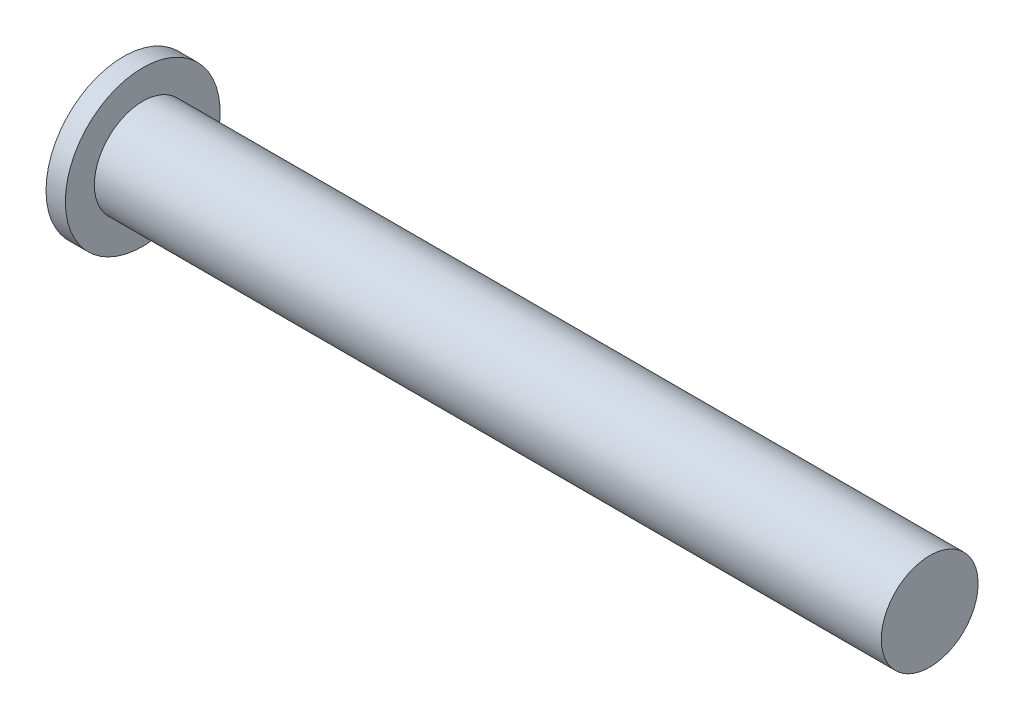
ISO-10303-21;
HEADER;
FILE_DESCRIPTION(('STEP AP214'),'2;1');
FILE_NAME('part.step','',(''),(''),'','','');
FILE_SCHEMA(('AUTOMOTIVE_DESIGN { 1 0 10303 214 1 1 1 1 }'));
ENDSEC;
DATA;
#1=APPLICATION_CONTEXT('core data for automotive mechanical design processes');
#2=APPLICATION_PROTOCOL_DEFINITION('international standard','automotive_design',2000,#1);
#3=PRODUCT_CONTEXT('',#1,'mechanical');
#4=PRODUCT('Part','Part','',(#3));
#5=PRODUCT_RELATED_PRODUCT_CATEGORY('part','',(#4));
#6=PRODUCT_DEFINITION_FORMATION('','',#4);
#7=PRODUCT_DEFINITION_CONTEXT('part definition',#1,'design');
#8=PRODUCT_DEFINITION('design','',#6,#7);
#9=PRODUCT_DEFINITION_SHAPE('','',#8);
#10=(LENGTH_UNIT() NAMED_UNIT(*) SI_UNIT(.MILLI.,.METRE.));
#11=(NAMED_UNIT(*) PLANE_ANGLE_UNIT() SI_UNIT($,.RADIAN.));
#12=(NAMED_UNIT(*) SI_UNIT($,.STERADIAN.) SOLID_ANGLE_UNIT());
#13=UNCERTAINTY_MEASURE_WITH_UNIT(LENGTH_MEASURE(1.E-05),#10,'distance_accuracy_value','');
#14=(GEOMETRIC_REPRESENTATION_CONTEXT(3) GLOBAL_UNCERTAINTY_ASSIGNED_CONTEXT((#13)) GLOBAL_UNIT_ASSIGNED_CONTEXT((#10,
#11,#12)) REPRESENTATION_CONTEXT('',''));
#15=CARTESIAN_POINT('',(0.,0.,0.));
#16=DIRECTION('',(0.,0.,1.));
#17=DIRECTION('',(1.,0.,0.));
#18=AXIS2_PLACEMENT_3D('',#15,#16,#17);
#19=CARTESIAN_POINT('',(0.,0.,0.));
#20=DIRECTION('',(1.,0.,0.));
#21=DIRECTION('',(0.,0.,-1.));
#22=AXIS2_PLACEMENT_3D('',#19,#20,#21);
#23=PLANE('',#22);
#24=CARTESIAN_POINT('',(0.,0.,0.));
#25=DIRECTION('',(-1.,0.,0.));
#26=DIRECTION('',(0.,0.,1.));
#27=AXIS2_PLACEMENT_3D('',#24,#25,#26);
#28=CIRCLE('',#27,4.8768);
#29=CARTESIAN_POINT('',(0.,0.,4.8768));
#30=VERTEX_POINT('',#29);
#31=EDGE_CURVE('E10',#30,#30,#28,.T.);
#32=ORIENTED_EDGE('',*,*,#31,.T.);
#33=EDGE_LOOP('',(#32));
#34=FACE_BOUND('',#33,.T.);
#35=ADVANCED_FACE('F31',(#34),#23,.F.);
#36=CARTESIAN_POINT('',(50.8,0.,0.));
#37=DIRECTION('',(-1.,0.,0.));
#38=DIRECTION('',(0.,0.,1.));
#39=AXIS2_PLACEMENT_3D('',#36,#37,#38);
#40=CYLINDRICAL_SURFACE('',#39,4.8768);
#41=ORIENTED_EDGE('',*,*,#31,.F.);
#42=EDGE_LOOP('',(#41));
#43=FACE_BOUND('',#42,.T.);
#44=CARTESIAN_POINT('',(1.2192,0.,0.));
#45=DIRECTION('',(-1.,0.,0.));
#46=DIRECTION('',(0.,0.,1.));
#47=AXIS2_PLACEMENT_3D('',#44,#45,#46);
#48=CIRCLE('',#47,4.8768);
#49=CARTESIAN_POINT('',(1.2192,0.,4.8768));
#50=VERTEX_POINT('',#49);
#51=EDGE_CURVE('E37',#50,#50,#48,.T.);
#52=ORIENTED_EDGE('',*,*,#51,.T.);
#53=EDGE_LOOP('',(#52));
#54=FACE_BOUND('',#53,.T.);
#55=ADVANCED_FACE('F63',(#43,#54),#40,.T.);
#56=CARTESIAN_POINT('',(1.2192,4.8768,0.));
#57=DIRECTION('',(-1.,0.,0.));
#58=DIRECTION('',(0.,0.,1.));
#59=AXIS2_PLACEMENT_3D('',#56,#57,#58);
#60=PLANE('',#59);
#61=ORIENTED_EDGE('',*,*,#51,.F.);
#62=EDGE_LOOP('',(#61));
#63=FACE_BOUND('',#62,.T.);
#64=CARTESIAN_POINT('',(1.2192,0.,0.));
#65=DIRECTION('',(-1.,0.,0.));
#66=DIRECTION('',(0.,0.,1.));
#67=AXIS2_PLACEMENT_3D('',#64,#65,#66);
#68=CIRCLE('',#67,3.048);
#69=CARTESIAN_POINT('',(1.2192,0.,3.048));
#70=VERTEX_POINT('',#69);
#71=EDGE_CURVE('E41',#70,#70,#68,.T.);
#72=ORIENTED_EDGE('',*,*,#71,.T.);
#73=EDGE_LOOP('',(#72));
#74=FACE_BOUND('',#73,.T.);
#75=ADVANCED_FACE('F59',(#63,#74),#60,.F.);
#76=CARTESIAN_POINT('',(50.8,0.,0.));
#77=DIRECTION('',(-1.,0.,0.));
#78=DIRECTION('',(0.,0.,1.));
#79=AXIS2_PLACEMENT_3D('',#76,#77,#78);
#80=CYLINDRICAL_SURFACE('',#79,3.048);
#81=ORIENTED_EDGE('',*,*,#71,.F.);
#82=EDGE_LOOP('',(#81));
#83=FACE_BOUND('',#82,.T.);
#84=CARTESIAN_POINT('',(50.8,0.,0.));
#85=DIRECTION('',(-1.,0.,0.));
#86=DIRECTION('',(0.,0.,1.));
#87=AXIS2_PLACEMENT_3D('',#84,#85,#86);
#88=CIRCLE('',#87,3.048);
#89=CARTESIAN_POINT('',(50.8,0.,3.048));
#90=VERTEX_POINT('',#89);
#91=EDGE_CURVE('E45',#90,#90,#88,.T.);
#92=ORIENTED_EDGE('',*,*,#91,.T.);
#93=EDGE_LOOP('',(#92));
#94=FACE_BOUND('',#93,.T.);
#95=ADVANCED_FACE('F51',(#83,#94),#80,.T.);
#96=CARTESIAN_POINT('',(50.8,3.048,0.));
#97=DIRECTION('',(-1.,0.,0.));
#98=DIRECTION('',(0.,0.,1.));
#99=AXIS2_PLACEMENT_3D('',#96,#97,#98);
#100=PLANE('',#99);
#101=ORIENTED_EDGE('',*,*,#91,.F.);
#102=EDGE_LOOP('',(#101));
#103=FACE_BOUND('',#102,.T.);
#104=ADVANCED_FACE('F53',(#103),#100,.F.);
#105=CLOSED_SHELL('',(#35,#55,#75,#95,#104));
#106=MANIFOLD_SOLID_BREP('B2',#105);
#107=ADVANCED_BREP_SHAPE_REPRESENTATION('',(#18,#106),#14);
#108=SHAPE_DEFINITION_REPRESENTATION(#9,#107);
ENDSEC;
END-ISO-10303-21;
